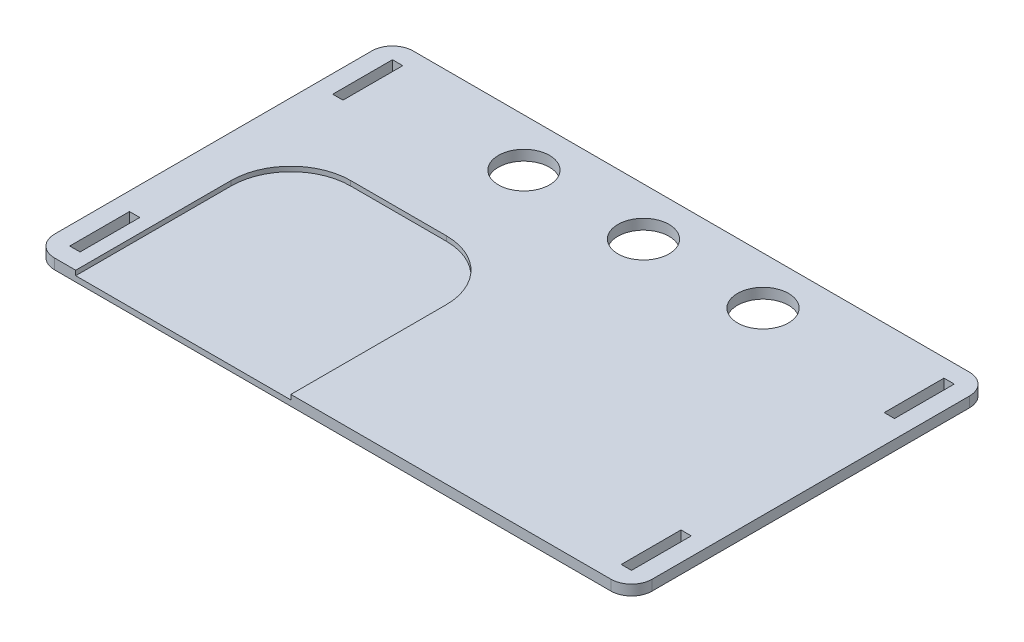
ISO-10303-21;
HEADER;
FILE_DESCRIPTION(('STEP AP214'),'2;1');
FILE_NAME('part.step','',(''),(''),'','','');
FILE_SCHEMA(('AUTOMOTIVE_DESIGN { 1 0 10303 214 1 1 1 1 }'));
ENDSEC;
DATA;
#1=APPLICATION_CONTEXT('core data for automotive mechanical design processes');
#2=APPLICATION_PROTOCOL_DEFINITION('international standard','automotive_design',2000,#1);
#3=PRODUCT_CONTEXT('',#1,'mechanical');
#4=PRODUCT('Part','Part','',(#3));
#5=PRODUCT_RELATED_PRODUCT_CATEGORY('part','',(#4));
#6=PRODUCT_DEFINITION_FORMATION('','',#4);
#7=PRODUCT_DEFINITION_CONTEXT('part definition',#1,'design');
#8=PRODUCT_DEFINITION('design','',#6,#7);
#9=PRODUCT_DEFINITION_SHAPE('','',#8);
#10=(LENGTH_UNIT() NAMED_UNIT(*) SI_UNIT(.MILLI.,.METRE.));
#11=(NAMED_UNIT(*) PLANE_ANGLE_UNIT() SI_UNIT($,.RADIAN.));
#12=(NAMED_UNIT(*) SI_UNIT($,.STERADIAN.) SOLID_ANGLE_UNIT());
#13=UNCERTAINTY_MEASURE_WITH_UNIT(LENGTH_MEASURE(1.E-05),#10,'distance_accuracy_value','');
#14=(GEOMETRIC_REPRESENTATION_CONTEXT(3) GLOBAL_UNCERTAINTY_ASSIGNED_CONTEXT((#13)) GLOBAL_UNIT_ASSIGNED_CONTEXT((#10,
#11,#12)) REPRESENTATION_CONTEXT('',''));
#15=CARTESIAN_POINT('',(0.,0.,0.));
#16=DIRECTION('',(0.,0.,1.));
#17=DIRECTION('',(1.,0.,0.));
#18=AXIS2_PLACEMENT_3D('',#15,#16,#17);
#19=CARTESIAN_POINT('',(0.,17.25,0.));
#20=DIRECTION('',(0.,-1.,0.));
#21=DIRECTION('',(0.,0.,-1.));
#22=AXIS2_PLACEMENT_3D('',#19,#20,#21);
#23=PLANE('',#22);
#24=CARTESIAN_POINT('',(-200.,17.25,-220.));
#25=DIRECTION('',(0.,-1.,0.));
#26=DIRECTION('',(0.,0.,-1.));
#27=AXIS2_PLACEMENT_3D('',#24,#25,#26);
#28=CIRCLE('',#27,42.75);
#29=CARTESIAN_POINT('',(-200.,17.25,-262.75));
#30=VERTEX_POINT('',#29);
#31=EDGE_CURVE('E844',#30,#30,#28,.T.);
#32=ORIENTED_EDGE('',*,*,#31,.T.);
#33=EDGE_LOOP('',(#32));
#34=FACE_BOUND('',#33,.T.);
#35=DIRECTION('',(0.,0.,-1.));
#36=VECTOR('',#35,1.);
#37=CARTESIAN_POINT('',(452.75,17.25,0.));
#38=LINE('',#37,#36);
#39=CARTESIAN_POINT('',(452.75,17.25,270.));
#40=VERTEX_POINT('',#39);
#41=CARTESIAN_POINT('',(452.75,17.25,170.));
#42=VERTEX_POINT('',#41);
#43=EDGE_CURVE('E48',#40,#42,#38,.T.);
#44=ORIENTED_EDGE('',*,*,#43,.T.);
#45=DIRECTION('',(1.,0.,0.));
#46=VECTOR('',#45,1.);
#47=CARTESIAN_POINT('',(-2.73533208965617E-13,17.25,169.999999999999));
#48=LINE('',#47,#46);
#49=CARTESIAN_POINT('',(470.,17.25,170.));
#50=VERTEX_POINT('',#49);
#51=EDGE_CURVE('E244',#42,#50,#48,.T.);
#52=ORIENTED_EDGE('',*,*,#51,.T.);
#53=DIRECTION('',(0.,0.,1.));
#54=VECTOR('',#53,1.);
#55=CARTESIAN_POINT('',(470.,17.25,0.));
#56=LINE('',#55,#54);
#57=CARTESIAN_POINT('',(470.,17.25,270.));
#58=VERTEX_POINT('',#57);
#59=EDGE_CURVE('E261',#50,#58,#56,.T.);
#60=ORIENTED_EDGE('',*,*,#59,.T.);
#61=DIRECTION('',(-1.,0.,0.));
#62=VECTOR('',#61,1.);
#63=CARTESIAN_POINT('',(0.,17.25,270.));
#64=LINE('',#63,#62);
#65=EDGE_CURVE('E238',#58,#40,#64,.T.);
#66=ORIENTED_EDGE('',*,*,#65,.T.);
#67=EDGE_LOOP('',(#44,#52,#60,#66));
#68=FACE_BOUND('',#67,.T.);
#69=DIRECTION('',(-1.,0.,0.));
#70=VECTOR('',#69,1.);
#71=CARTESIAN_POINT('',(0.,17.25,-270.));
#72=LINE('',#71,#70);
#73=CARTESIAN_POINT('',(470.,17.25,-270.));
#74=VERTEX_POINT('',#73);
#75=CARTESIAN_POINT('',(452.75,17.25,-270.));
#76=VERTEX_POINT('',#75);
#77=EDGE_CURVE('E284',#74,#76,#72,.T.);
#78=ORIENTED_EDGE('',*,*,#77,.F.);
#79=DIRECTION('',(0.,0.,-1.));
#80=VECTOR('',#79,1.);
#81=CARTESIAN_POINT('',(470.,17.25,0.));
#82=LINE('',#81,#80);
#83=CARTESIAN_POINT('',(470.,17.25,-170.));
#84=VERTEX_POINT('',#83);
#85=EDGE_CURVE('E245',#84,#74,#82,.T.);
#86=ORIENTED_EDGE('',*,*,#85,.F.);
#87=DIRECTION('',(1.,0.,0.));
#88=VECTOR('',#87,1.);
#89=CARTESIAN_POINT('',(-2.73533208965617E-13,17.25,-169.999999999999));
#90=LINE('',#89,#88);
#91=CARTESIAN_POINT('',(452.75,17.25,-170.));
#92=VERTEX_POINT('',#91);
#93=EDGE_CURVE('E273',#92,#84,#90,.T.);
#94=ORIENTED_EDGE('',*,*,#93,.F.);
#95=DIRECTION('',(0.,0.,1.));
#96=VECTOR('',#95,1.);
#97=CARTESIAN_POINT('',(452.75,17.25,0.));
#98=LINE('',#97,#96);
#99=EDGE_CURVE('E287',#76,#92,#98,.T.);
#100=ORIENTED_EDGE('',*,*,#99,.F.);
#101=EDGE_LOOP('',(#78,#86,#94,#100));
#102=FACE_BOUND('',#101,.T.);
#103=DIRECTION('',(1.,0.,0.));
#104=VECTOR('',#103,1.);
#105=CARTESIAN_POINT('',(-500.,17.25,300.));
#106=LINE('',#105,#104);
#107=CARTESIAN_POINT('',(-465.5,17.25,300.));
#108=VERTEX_POINT('',#107);
#109=CARTESIAN_POINT('',(-430.,17.25,300.));
#110=VERTEX_POINT('',#109);
#111=EDGE_CURVE('E399',#108,#110,#106,.T.);
#112=ORIENTED_EDGE('',*,*,#111,.T.);
#113=DIRECTION('',(0.,0.,1.));
#114=VECTOR('',#113,1.);
#115=CARTESIAN_POINT('',(-430.,17.25,0.));
#116=LINE('',#115,#114);
#117=CARTESIAN_POINT('',(-430.,17.25,40.0000000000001));
#118=VERTEX_POINT('',#117);
#119=EDGE_CURVE('E357',#118,#110,#116,.T.);
#120=ORIENTED_EDGE('',*,*,#119,.F.);
#121=CARTESIAN_POINT('',(-330.,17.25,40.0000000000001));
#122=DIRECTION('',(0.,-1.,0.));
#123=DIRECTION('',(0.,0.,-1.));
#124=AXIS2_PLACEMENT_3D('',#121,#122,#123);
#125=CIRCLE('',#124,100.);
#126=CARTESIAN_POINT('',(-330.,17.25,-59.9999999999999));
#127=VERTEX_POINT('',#126);
#128=EDGE_CURVE('E11',#118,#127,#125,.T.);
#129=ORIENTED_EDGE('',*,*,#128,.T.);
#130=DIRECTION('',(-1.,0.,0.));
#131=VECTOR('',#130,1.);
#132=CARTESIAN_POINT('',(0.,17.25,-59.9999999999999));
#133=LINE('',#132,#131);
#134=CARTESIAN_POINT('',(-170.,17.25,-59.9999999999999));
#135=VERTEX_POINT('',#134);
#136=EDGE_CURVE('E367',#135,#127,#133,.T.);
#137=ORIENTED_EDGE('',*,*,#136,.F.);
#138=CARTESIAN_POINT('',(-170.,17.25,40.0000000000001));
#139=DIRECTION('',(0.,-1.,0.));
#140=DIRECTION('',(0.,0.,-1.));
#141=AXIS2_PLACEMENT_3D('',#138,#139,#140);
#142=CIRCLE('',#141,100.);
#143=CARTESIAN_POINT('',(-70.,17.25,40.0000000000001));
#144=VERTEX_POINT('',#143);
#145=EDGE_CURVE('E41',#135,#144,#142,.T.);
#146=ORIENTED_EDGE('',*,*,#145,.T.);
#147=DIRECTION('',(0.,0.,-1.));
#148=VECTOR('',#147,1.);
#149=CARTESIAN_POINT('',(-70.,17.25,0.));
#150=LINE('',#149,#148);
#151=CARTESIAN_POINT('',(-70.,17.25,300.));
#152=VERTEX_POINT('',#151);
#153=EDGE_CURVE('E378',#152,#144,#150,.T.);
#154=ORIENTED_EDGE('',*,*,#153,.F.);
#155=CARTESIAN_POINT('',(465.5,17.25,300.));
#156=VERTEX_POINT('',#155);
#157=EDGE_CURVE('E398',#152,#156,#106,.T.);
#158=ORIENTED_EDGE('',*,*,#157,.T.);
#159=CARTESIAN_POINT('',(465.5,17.25,265.5));
#160=DIRECTION('',(0.,-1.,0.));
#161=DIRECTION('',(0.,0.,-1.));
#162=AXIS2_PLACEMENT_3D('',#159,#160,#161);
#163=CIRCLE('',#162,34.5);
#164=CARTESIAN_POINT('',(500.,17.25,265.5));
#165=VERTEX_POINT('',#164);
#166=EDGE_CURVE('E437',#156,#165,#163,.F.);
#167=ORIENTED_EDGE('',*,*,#166,.T.);
#168=DIRECTION('',(0.,0.,-1.));
#169=VECTOR('',#168,1.);
#170=CARTESIAN_POINT('',(500.,17.25,300.));
#171=LINE('',#170,#169);
#172=CARTESIAN_POINT('',(500.,17.25,-265.5));
#173=VERTEX_POINT('',#172);
#174=EDGE_CURVE('E388',#165,#173,#171,.T.);
#175=ORIENTED_EDGE('',*,*,#174,.T.);
#176=CARTESIAN_POINT('',(465.5,17.25,-265.5));
#177=DIRECTION('',(0.,-1.,0.));
#178=DIRECTION('',(0.,0.,-1.));
#179=AXIS2_PLACEMENT_3D('',#176,#177,#178);
#180=CIRCLE('',#179,34.5);
#181=CARTESIAN_POINT('',(465.5,17.25,-300.));
#182=VERTEX_POINT('',#181);
#183=EDGE_CURVE('E435',#173,#182,#180,.F.);
#184=ORIENTED_EDGE('',*,*,#183,.T.);
#185=DIRECTION('',(-1.,0.,0.));
#186=VECTOR('',#185,1.);
#187=CARTESIAN_POINT('',(-500.,17.25,-300.));
#188=LINE('',#187,#186);
#189=CARTESIAN_POINT('',(-465.5,17.25,-300.));
#190=VERTEX_POINT('',#189);
#191=EDGE_CURVE('E391',#182,#190,#188,.T.);
#192=ORIENTED_EDGE('',*,*,#191,.T.);
#193=CARTESIAN_POINT('',(-465.5,17.25,-265.5));
#194=DIRECTION('',(0.,-1.,0.));
#195=DIRECTION('',(0.,0.,-1.));
#196=AXIS2_PLACEMENT_3D('',#193,#194,#195);
#197=CIRCLE('',#196,34.5);
#198=CARTESIAN_POINT('',(-500.,17.25,-265.5));
#199=VERTEX_POINT('',#198);
#200=EDGE_CURVE('E431',#190,#199,#197,.F.);
#201=ORIENTED_EDGE('',*,*,#200,.T.);
#202=DIRECTION('',(0.,0.,1.));
#203=VECTOR('',#202,1.);
#204=CARTESIAN_POINT('',(-500.,17.25,300.));
#205=LINE('',#204,#203);
#206=CARTESIAN_POINT('',(-500.,17.25,265.5));
#207=VERTEX_POINT('',#206);
#208=EDGE_CURVE('E395',#199,#207,#205,.T.);
#209=ORIENTED_EDGE('',*,*,#208,.T.);
#210=CARTESIAN_POINT('',(-465.5,17.25,265.5));
#211=DIRECTION('',(0.,-1.,0.));
#212=DIRECTION('',(0.,0.,-1.));
#213=AXIS2_PLACEMENT_3D('',#210,#211,#212);
#214=CIRCLE('',#213,34.5);
#215=EDGE_CURVE('E433',#207,#108,#214,.F.);
#216=ORIENTED_EDGE('',*,*,#215,.T.);
#217=EDGE_LOOP('',(#112,#120,#129,#137,#146,#154,#158,#167,#175,#184,#192,#201,#209,#216));
#218=FACE_BOUND('',#217,.T.);
#219=DIRECTION('',(1.,0.,0.));
#220=VECTOR('',#219,1.);
#221=CARTESIAN_POINT('',(0.,17.25,270.));
#222=LINE('',#221,#220);
#223=CARTESIAN_POINT('',(-470.,17.25,270.));
#224=VERTEX_POINT('',#223);
#225=CARTESIAN_POINT('',(-452.75,17.25,270.));
#226=VERTEX_POINT('',#225);
#227=EDGE_CURVE('E347',#224,#226,#222,.T.);
#228=ORIENTED_EDGE('',*,*,#227,.F.);
#229=DIRECTION('',(0.,0.,1.));
#230=VECTOR('',#229,1.);
#231=CARTESIAN_POINT('',(-470.,17.25,0.));
#232=LINE('',#231,#230);
#233=CARTESIAN_POINT('',(-470.,17.25,170.));
#234=VERTEX_POINT('',#233);
#235=EDGE_CURVE('E331',#234,#224,#232,.T.);
#236=ORIENTED_EDGE('',*,*,#235,.F.);
#237=DIRECTION('',(-1.,0.,0.));
#238=VECTOR('',#237,1.);
#239=CARTESIAN_POINT('',(2.73533208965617E-13,17.25,169.999999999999));
#240=LINE('',#239,#238);
#241=CARTESIAN_POINT('',(-452.75,17.25,170.));
#242=VERTEX_POINT('',#241);
#243=EDGE_CURVE('E336',#242,#234,#240,.T.);
#244=ORIENTED_EDGE('',*,*,#243,.F.);
#245=DIRECTION('',(0.,0.,-1.));
#246=VECTOR('',#245,1.);
#247=CARTESIAN_POINT('',(-452.75,17.25,0.));
#248=LINE('',#247,#246);
#249=EDGE_CURVE('E350',#226,#242,#248,.T.);
#250=ORIENTED_EDGE('',*,*,#249,.F.);
#251=EDGE_LOOP('',(#228,#236,#244,#250));
#252=FACE_BOUND('',#251,.T.);
#253=DIRECTION('',(0.,0.,1.));
#254=VECTOR('',#253,1.);
#255=CARTESIAN_POINT('',(-452.75,17.25,0.));
#256=LINE('',#255,#254);
#257=CARTESIAN_POINT('',(-452.75,17.25,-270.));
#258=VERTEX_POINT('',#257);
#259=CARTESIAN_POINT('',(-452.75,17.25,-170.));
#260=VERTEX_POINT('',#259);
#261=EDGE_CURVE('E294',#258,#260,#256,.T.);
#262=ORIENTED_EDGE('',*,*,#261,.T.);
#263=DIRECTION('',(-1.,0.,0.));
#264=VECTOR('',#263,1.);
#265=CARTESIAN_POINT('',(2.73533208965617E-13,17.25,-169.999999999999));
#266=LINE('',#265,#264);
#267=CARTESIAN_POINT('',(-470.,17.25,-170.));
#268=VERTEX_POINT('',#267);
#269=EDGE_CURVE('E314',#260,#268,#266,.T.);
#270=ORIENTED_EDGE('',*,*,#269,.T.);
#271=DIRECTION('',(0.,0.,-1.));
#272=VECTOR('',#271,1.);
#273=CARTESIAN_POINT('',(-470.,17.25,0.));
#274=LINE('',#273,#272);
#275=CARTESIAN_POINT('',(-470.,17.25,-270.));
#276=VERTEX_POINT('',#275);
#277=EDGE_CURVE('E317',#268,#276,#274,.T.);
#278=ORIENTED_EDGE('',*,*,#277,.T.);
#279=DIRECTION('',(1.,0.,0.));
#280=VECTOR('',#279,1.);
#281=CARTESIAN_POINT('',(0.,17.25,-270.));
#282=LINE('',#281,#280);
#283=EDGE_CURVE('E304',#276,#258,#282,.T.);
#284=ORIENTED_EDGE('',*,*,#283,.T.);
#285=EDGE_LOOP('',(#262,#270,#278,#284));
#286=FACE_BOUND('',#285,.T.);
#287=CARTESIAN_POINT('',(0.,17.25,-220.));
#288=DIRECTION('',(0.,-1.,0.));
#289=DIRECTION('',(0.,0.,-1.));
#290=AXIS2_PLACEMENT_3D('',#287,#288,#289);
#291=CIRCLE('',#290,42.75);
#292=CARTESIAN_POINT('',(0.,17.25,-262.75));
#293=VERTEX_POINT('',#292);
#294=EDGE_CURVE('E850',#293,#293,#291,.T.);
#295=ORIENTED_EDGE('',*,*,#294,.T.);
#296=EDGE_LOOP('',(#295));
#297=FACE_BOUND('',#296,.T.);
#298=CARTESIAN_POINT('',(200.,17.25,-220.));
#299=DIRECTION('',(0.,-1.,0.));
#300=DIRECTION('',(0.,0.,-1.));
#301=AXIS2_PLACEMENT_3D('',#298,#299,#300);
#302=CIRCLE('',#301,42.75);
#303=CARTESIAN_POINT('',(200.,17.25,-262.75));
#304=VERTEX_POINT('',#303);
#305=EDGE_CURVE('E841',#304,#304,#302,.T.);
#306=ORIENTED_EDGE('',*,*,#305,.T.);
#307=EDGE_LOOP('',(#306));
#308=FACE_BOUND('',#307,.T.);
#309=ADVANCED_FACE('F33',(#34,#68,#102,#218,#252,#286,#297,#308),#23,.F.);
#310=CARTESIAN_POINT('',(0.,0.,0.));
#311=DIRECTION('',(0.,-1.,0.));
#312=DIRECTION('',(0.,0.,-1.));
#313=AXIS2_PLACEMENT_3D('',#310,#311,#312);
#314=PLANE('',#313);
#315=CARTESIAN_POINT('',(-200.,0.,-220.));
#316=DIRECTION('',(0.,-1.,0.));
#317=DIRECTION('',(0.,0.,-1.));
#318=AXIS2_PLACEMENT_3D('',#315,#316,#317);
#319=CIRCLE('',#318,42.75);
#320=CARTESIAN_POINT('',(-200.,0.,-262.75));
#321=VERTEX_POINT('',#320);
#322=EDGE_CURVE('E847',#321,#321,#319,.T.);
#323=ORIENTED_EDGE('',*,*,#322,.F.);
#324=EDGE_LOOP('',(#323));
#325=FACE_BOUND('',#324,.T.);
#326=DIRECTION('',(1.,0.,0.));
#327=VECTOR('',#326,1.);
#328=CARTESIAN_POINT('',(-2.73533208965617E-13,0.,169.999999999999));
#329=LINE('',#328,#327);
#330=CARTESIAN_POINT('',(452.75,0.,170.));
#331=VERTEX_POINT('',#330);
#332=CARTESIAN_POINT('',(470.,0.,170.));
#333=VERTEX_POINT('',#332);
#334=EDGE_CURVE('E237',#331,#333,#329,.T.);
#335=ORIENTED_EDGE('',*,*,#334,.F.);
#336=DIRECTION('',(0.,0.,-1.));
#337=VECTOR('',#336,1.);
#338=CARTESIAN_POINT('',(452.75,0.,0.));
#339=LINE('',#338,#337);
#340=CARTESIAN_POINT('',(452.75,0.,270.));
#341=VERTEX_POINT('',#340);
#342=EDGE_CURVE('E229',#341,#331,#339,.T.);
#343=ORIENTED_EDGE('',*,*,#342,.F.);
#344=DIRECTION('',(-1.,0.,0.));
#345=VECTOR('',#344,1.);
#346=CARTESIAN_POINT('',(0.,0.,270.));
#347=LINE('',#346,#345);
#348=CARTESIAN_POINT('',(470.,0.,270.));
#349=VERTEX_POINT('',#348);
#350=EDGE_CURVE('E253',#349,#341,#347,.T.);
#351=ORIENTED_EDGE('',*,*,#350,.F.);
#352=DIRECTION('',(0.,0.,1.));
#353=VECTOR('',#352,1.);
#354=CARTESIAN_POINT('',(470.,0.,0.));
#355=LINE('',#354,#353);
#356=EDGE_CURVE('E251',#333,#349,#355,.T.);
#357=ORIENTED_EDGE('',*,*,#356,.F.);
#358=EDGE_LOOP('',(#335,#343,#351,#357));
#359=FACE_BOUND('',#358,.T.);
#360=DIRECTION('',(0.,0.,-1.));
#361=VECTOR('',#360,1.);
#362=CARTESIAN_POINT('',(470.,0.,0.));
#363=LINE('',#362,#361);
#364=CARTESIAN_POINT('',(470.,0.,-170.));
#365=VERTEX_POINT('',#364);
#366=CARTESIAN_POINT('',(470.,0.,-270.));
#367=VERTEX_POINT('',#366);
#368=EDGE_CURVE('E269',#365,#367,#363,.T.);
#369=ORIENTED_EDGE('',*,*,#368,.T.);
#370=DIRECTION('',(-1.,0.,0.));
#371=VECTOR('',#370,1.);
#372=CARTESIAN_POINT('',(0.,0.,-270.));
#373=LINE('',#372,#371);
#374=CARTESIAN_POINT('',(452.75,0.,-270.));
#375=VERTEX_POINT('',#374);
#376=EDGE_CURVE('E272',#367,#375,#373,.T.);
#377=ORIENTED_EDGE('',*,*,#376,.T.);
#378=DIRECTION('',(0.,0.,1.));
#379=VECTOR('',#378,1.);
#380=CARTESIAN_POINT('',(452.75,0.,0.));
#381=LINE('',#380,#379);
#382=CARTESIAN_POINT('',(452.75,0.,-170.));
#383=VERTEX_POINT('',#382);
#384=EDGE_CURVE('E276',#375,#383,#381,.T.);
#385=ORIENTED_EDGE('',*,*,#384,.T.);
#386=DIRECTION('',(1.,0.,0.));
#387=VECTOR('',#386,1.);
#388=CARTESIAN_POINT('',(-2.73533208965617E-13,0.,-169.999999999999));
#389=LINE('',#388,#387);
#390=EDGE_CURVE('E279',#383,#365,#389,.T.);
#391=ORIENTED_EDGE('',*,*,#390,.T.);
#392=EDGE_LOOP('',(#369,#377,#385,#391));
#393=FACE_BOUND('',#392,.T.);
#394=DIRECTION('',(0.,0.,-1.));
#395=VECTOR('',#394,1.);
#396=CARTESIAN_POINT('',(500.,0.,300.));
#397=LINE('',#396,#395);
#398=CARTESIAN_POINT('',(500.,0.,265.5));
#399=VERTEX_POINT('',#398);
#400=CARTESIAN_POINT('',(500.,0.,-265.5));
#401=VERTEX_POINT('',#400);
#402=EDGE_CURVE('E385',#399,#401,#397,.T.);
#403=ORIENTED_EDGE('',*,*,#402,.F.);
#404=CARTESIAN_POINT('',(465.5,0.,265.5));
#405=DIRECTION('',(0.,-1.,0.));
#406=DIRECTION('',(0.,0.,-1.));
#407=AXIS2_PLACEMENT_3D('',#404,#405,#406);
#408=CIRCLE('',#407,34.5);
#409=CARTESIAN_POINT('',(465.5,0.,300.));
#410=VERTEX_POINT('',#409);
#411=EDGE_CURVE('E423',#399,#410,#408,.T.);
#412=ORIENTED_EDGE('',*,*,#411,.T.);
#413=DIRECTION('',(1.,0.,0.));
#414=VECTOR('',#413,1.);
#415=CARTESIAN_POINT('',(-500.,0.,300.));
#416=LINE('',#415,#414);
#417=CARTESIAN_POINT('',(-465.5,0.,300.));
#418=VERTEX_POINT('',#417);
#419=EDGE_CURVE('E392',#418,#410,#416,.T.);
#420=ORIENTED_EDGE('',*,*,#419,.F.);
#421=CARTESIAN_POINT('',(-465.5,0.,265.5));
#422=DIRECTION('',(0.,-1.,0.));
#423=DIRECTION('',(0.,0.,-1.));
#424=AXIS2_PLACEMENT_3D('',#421,#422,#423);
#425=CIRCLE('',#424,34.5);
#426=CARTESIAN_POINT('',(-500.,0.,265.5));
#427=VERTEX_POINT('',#426);
#428=EDGE_CURVE('E419',#418,#427,#425,.T.);
#429=ORIENTED_EDGE('',*,*,#428,.T.);
#430=DIRECTION('',(0.,0.,1.));
#431=VECTOR('',#430,1.);
#432=CARTESIAN_POINT('',(-500.,0.,300.));
#433=LINE('',#432,#431);
#434=CARTESIAN_POINT('',(-500.,0.,-265.5));
#435=VERTEX_POINT('',#434);
#436=EDGE_CURVE('E408',#435,#427,#433,.T.);
#437=ORIENTED_EDGE('',*,*,#436,.F.);
#438=CARTESIAN_POINT('',(-465.5,0.,-265.5));
#439=DIRECTION('',(0.,-1.,0.));
#440=DIRECTION('',(0.,0.,-1.));
#441=AXIS2_PLACEMENT_3D('',#438,#439,#440);
#442=CIRCLE('',#441,34.5);
#443=CARTESIAN_POINT('',(-465.5,0.,-300.));
#444=VERTEX_POINT('',#443);
#445=EDGE_CURVE('E417',#435,#444,#442,.T.);
#446=ORIENTED_EDGE('',*,*,#445,.T.);
#447=DIRECTION('',(-1.,0.,0.));
#448=VECTOR('',#447,1.);
#449=CARTESIAN_POINT('',(-500.,0.,-300.));
#450=LINE('',#449,#448);
#451=CARTESIAN_POINT('',(465.5,0.,-300.));
#452=VERTEX_POINT('',#451);
#453=EDGE_CURVE('E405',#452,#444,#450,.T.);
#454=ORIENTED_EDGE('',*,*,#453,.F.);
#455=CARTESIAN_POINT('',(465.5,0.,-265.5));
#456=DIRECTION('',(0.,-1.,0.));
#457=DIRECTION('',(0.,0.,-1.));
#458=AXIS2_PLACEMENT_3D('',#455,#456,#457);
#459=CIRCLE('',#458,34.5);
#460=EDGE_CURVE('E421',#452,#401,#459,.T.);
#461=ORIENTED_EDGE('',*,*,#460,.T.);
#462=EDGE_LOOP('',(#403,#412,#420,#429,#437,#446,#454,#461));
#463=FACE_BOUND('',#462,.T.);
#464=DIRECTION('',(0.,0.,1.));
#465=VECTOR('',#464,1.);
#466=CARTESIAN_POINT('',(-470.,0.,0.));
#467=LINE('',#466,#465);
#468=CARTESIAN_POINT('',(-470.,0.,170.));
#469=VERTEX_POINT('',#468);
#470=CARTESIAN_POINT('',(-470.,0.,270.));
#471=VERTEX_POINT('',#470);
#472=EDGE_CURVE('E332',#469,#471,#467,.T.);
#473=ORIENTED_EDGE('',*,*,#472,.T.);
#474=DIRECTION('',(1.,0.,0.));
#475=VECTOR('',#474,1.);
#476=CARTESIAN_POINT('',(0.,0.,270.));
#477=LINE('',#476,#475);
#478=CARTESIAN_POINT('',(-452.75,0.,270.));
#479=VERTEX_POINT('',#478);
#480=EDGE_CURVE('E335',#471,#479,#477,.T.);
#481=ORIENTED_EDGE('',*,*,#480,.T.);
#482=DIRECTION('',(0.,0.,-1.));
#483=VECTOR('',#482,1.);
#484=CARTESIAN_POINT('',(-452.75,0.,0.));
#485=LINE('',#484,#483);
#486=CARTESIAN_POINT('',(-452.75,0.,170.));
#487=VERTEX_POINT('',#486);
#488=EDGE_CURVE('E339',#479,#487,#485,.T.);
#489=ORIENTED_EDGE('',*,*,#488,.T.);
#490=DIRECTION('',(-1.,0.,0.));
#491=VECTOR('',#490,1.);
#492=CARTESIAN_POINT('',(2.73533208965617E-13,0.,169.999999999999));
#493=LINE('',#492,#491);
#494=EDGE_CURVE('E342',#487,#469,#493,.T.);
#495=ORIENTED_EDGE('',*,*,#494,.T.);
#496=EDGE_LOOP('',(#473,#481,#489,#495));
#497=FACE_BOUND('',#496,.T.);
#498=DIRECTION('',(-1.,0.,0.));
#499=VECTOR('',#498,1.);
#500=CARTESIAN_POINT('',(2.73533208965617E-13,0.,-169.999999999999));
#501=LINE('',#500,#499);
#502=CARTESIAN_POINT('',(-452.75,0.,-170.));
#503=VERTEX_POINT('',#502);
#504=CARTESIAN_POINT('',(-470.,0.,-170.));
#505=VERTEX_POINT('',#504);
#506=EDGE_CURVE('E303',#503,#505,#501,.T.);
#507=ORIENTED_EDGE('',*,*,#506,.F.);
#508=DIRECTION('',(0.,0.,1.));
#509=VECTOR('',#508,1.);
#510=CARTESIAN_POINT('',(-452.75,0.,0.));
#511=LINE('',#510,#509);
#512=CARTESIAN_POINT('',(-452.75,0.,-270.));
#513=VERTEX_POINT('',#512);
#514=EDGE_CURVE('E301',#513,#503,#511,.T.);
#515=ORIENTED_EDGE('',*,*,#514,.F.);
#516=DIRECTION('',(1.,0.,0.));
#517=VECTOR('',#516,1.);
#518=CARTESIAN_POINT('',(0.,0.,-270.));
#519=LINE('',#518,#517);
#520=CARTESIAN_POINT('',(-470.,0.,-270.));
#521=VERTEX_POINT('',#520);
#522=EDGE_CURVE('E309',#521,#513,#519,.T.);
#523=ORIENTED_EDGE('',*,*,#522,.F.);
#524=DIRECTION('',(0.,0.,-1.));
#525=VECTOR('',#524,1.);
#526=CARTESIAN_POINT('',(-470.,0.,0.));
#527=LINE('',#526,#525);
#528=EDGE_CURVE('E306',#505,#521,#527,.T.);
#529=ORIENTED_EDGE('',*,*,#528,.F.);
#530=EDGE_LOOP('',(#507,#515,#523,#529));
#531=FACE_BOUND('',#530,.T.);
#532=CARTESIAN_POINT('',(0.,0.,-220.));
#533=DIRECTION('',(0.,-1.,0.));
#534=DIRECTION('',(0.,0.,-1.));
#535=AXIS2_PLACEMENT_3D('',#532,#533,#534);
#536=CIRCLE('',#535,42.75);
#537=CARTESIAN_POINT('',(0.,0.,-262.75));
#538=VERTEX_POINT('',#537);
#539=EDGE_CURVE('E259',#538,#538,#536,.T.);
#540=ORIENTED_EDGE('',*,*,#539,.F.);
#541=EDGE_LOOP('',(#540));
#542=FACE_BOUND('',#541,.T.);
#543=CARTESIAN_POINT('',(200.,0.,-220.));
#544=DIRECTION('',(0.,-1.,0.));
#545=DIRECTION('',(0.,0.,-1.));
#546=AXIS2_PLACEMENT_3D('',#543,#544,#545);
#547=CIRCLE('',#546,42.75);
#548=CARTESIAN_POINT('',(200.,0.,-262.75));
#549=VERTEX_POINT('',#548);
#550=EDGE_CURVE('E838',#549,#549,#547,.T.);
#551=ORIENTED_EDGE('',*,*,#550,.F.);
#552=EDGE_LOOP('',(#551));
#553=FACE_BOUND('',#552,.T.);
#554=ADVANCED_FACE('F249',(#325,#359,#393,#463,#497,#531,#542,#553),#314,.T.);
#555=CARTESIAN_POINT('',(500.,17.25,300.));
#556=DIRECTION('',(-1.,0.,0.));
#557=DIRECTION('',(0.,0.,1.));
#558=AXIS2_PLACEMENT_3D('',#555,#556,#557);
#559=PLANE('',#558);
#560=ORIENTED_EDGE('',*,*,#174,.F.);
#561=DIRECTION('',(0.,-1.,0.));
#562=VECTOR('',#561,1.);
#563=CARTESIAN_POINT('',(500.,17.25,265.5));
#564=LINE('',#563,#562);
#565=EDGE_CURVE('E414',#165,#399,#564,.T.);
#566=ORIENTED_EDGE('',*,*,#565,.T.);
#567=ORIENTED_EDGE('',*,*,#402,.T.);
#568=DIRECTION('',(0.,-1.,0.));
#569=VECTOR('',#568,1.);
#570=CARTESIAN_POINT('',(500.,17.25,-265.5));
#571=LINE('',#570,#569);
#572=EDGE_CURVE('E402',#401,#173,#571,.F.);
#573=ORIENTED_EDGE('',*,*,#572,.T.);
#574=EDGE_LOOP('',(#560,#566,#567,#573));
#575=FACE_BOUND('',#574,.T.);
#576=ADVANCED_FACE('F500',(#575),#559,.F.);
#577=CARTESIAN_POINT('',(-500.,17.25,-300.));
#578=DIRECTION('',(0.,0.,1.));
#579=DIRECTION('',(1.,0.,0.));
#580=AXIS2_PLACEMENT_3D('',#577,#578,#579);
#581=PLANE('',#580);
#582=ORIENTED_EDGE('',*,*,#191,.F.);
#583=DIRECTION('',(0.,-1.,0.));
#584=VECTOR('',#583,1.);
#585=CARTESIAN_POINT('',(465.5,17.25,-300.));
#586=LINE('',#585,#584);
#587=EDGE_CURVE('E441',#182,#452,#586,.T.);
#588=ORIENTED_EDGE('',*,*,#587,.T.);
#589=ORIENTED_EDGE('',*,*,#453,.T.);
#590=DIRECTION('',(0.,-1.,0.));
#591=VECTOR('',#590,1.);
#592=CARTESIAN_POINT('',(-465.5,17.25,-300.));
#593=LINE('',#592,#591);
#594=EDGE_CURVE('E439',#444,#190,#593,.F.);
#595=ORIENTED_EDGE('',*,*,#594,.T.);
#596=EDGE_LOOP('',(#582,#588,#589,#595));
#597=FACE_BOUND('',#596,.T.);
#598=ADVANCED_FACE('F524',(#597),#581,.F.);
#599=CARTESIAN_POINT('',(-500.,17.25,300.));
#600=DIRECTION('',(1.,0.,0.));
#601=DIRECTION('',(0.,0.,-1.));
#602=AXIS2_PLACEMENT_3D('',#599,#600,#601);
#603=PLANE('',#602);
#604=ORIENTED_EDGE('',*,*,#436,.T.);
#605=DIRECTION('',(0.,-1.,0.));
#606=VECTOR('',#605,1.);
#607=CARTESIAN_POINT('',(-500.,17.25,265.5));
#608=LINE('',#607,#606);
#609=EDGE_CURVE('E447',#427,#207,#608,.F.);
#610=ORIENTED_EDGE('',*,*,#609,.T.);
#611=ORIENTED_EDGE('',*,*,#208,.F.);
#612=DIRECTION('',(0.,-1.,0.));
#613=VECTOR('',#612,1.);
#614=CARTESIAN_POINT('',(-500.,17.25,-265.5));
#615=LINE('',#614,#613);
#616=EDGE_CURVE('E444',#199,#435,#615,.T.);
#617=ORIENTED_EDGE('',*,*,#616,.T.);
#618=EDGE_LOOP('',(#604,#610,#611,#617));
#619=FACE_BOUND('',#618,.T.);
#620=ADVANCED_FACE('F514',(#619),#603,.F.);
#621=CARTESIAN_POINT('',(-500.,17.25,300.));
#622=DIRECTION('',(0.,0.,-1.));
#623=DIRECTION('',(-1.,0.,0.));
#624=AXIS2_PLACEMENT_3D('',#621,#622,#623);
#625=PLANE('',#624);
#626=DIRECTION('',(1.,0.,0.));
#627=VECTOR('',#626,1.);
#628=CARTESIAN_POINT('',(0.,9.25,300.));
#629=LINE('',#628,#627);
#630=CARTESIAN_POINT('',(-430.,9.25,300.));
#631=VERTEX_POINT('',#630);
#632=CARTESIAN_POINT('',(-70.,9.25,300.));
#633=VERTEX_POINT('',#632);
#634=EDGE_CURVE('E366',#631,#633,#629,.T.);
#635=ORIENTED_EDGE('',*,*,#634,.F.);
#636=DIRECTION('',(0.,1.,0.));
#637=VECTOR('',#636,1.);
#638=CARTESIAN_POINT('',(-430.,9.25,300.));
#639=LINE('',#638,#637);
#640=EDGE_CURVE('E376',#631,#110,#639,.T.);
#641=ORIENTED_EDGE('',*,*,#640,.T.);
#642=ORIENTED_EDGE('',*,*,#111,.F.);
#643=DIRECTION('',(0.,-1.,0.));
#644=VECTOR('',#643,1.);
#645=CARTESIAN_POINT('',(-465.5,17.25,300.));
#646=LINE('',#645,#644);
#647=EDGE_CURVE('E425',#108,#418,#646,.T.);
#648=ORIENTED_EDGE('',*,*,#647,.T.);
#649=ORIENTED_EDGE('',*,*,#419,.T.);
#650=DIRECTION('',(0.,-1.,0.));
#651=VECTOR('',#650,1.);
#652=CARTESIAN_POINT('',(465.5,17.25,300.));
#653=LINE('',#652,#651);
#654=EDGE_CURVE('E428',#410,#156,#653,.F.);
#655=ORIENTED_EDGE('',*,*,#654,.T.);
#656=ORIENTED_EDGE('',*,*,#157,.F.);
#657=DIRECTION('',(0.,1.,0.));
#658=VECTOR('',#657,1.);
#659=CARTESIAN_POINT('',(-70.,9.25,300.));
#660=LINE('',#659,#658);
#661=EDGE_CURVE('E383',#633,#152,#660,.T.);
#662=ORIENTED_EDGE('',*,*,#661,.F.);
#663=EDGE_LOOP('',(#635,#641,#642,#648,#649,#655,#656,#662));
#664=FACE_BOUND('',#663,.T.);
#665=ADVANCED_FACE('F492',(#664),#625,.F.);
#666=CARTESIAN_POINT('',(465.5,17.25,265.5));
#667=DIRECTION('',(0.,-1.,0.));
#668=DIRECTION('',(0.,0.,-1.));
#669=AXIS2_PLACEMENT_3D('',#666,#667,#668);
#670=CYLINDRICAL_SURFACE('',#669,34.5);
#671=ORIENTED_EDGE('',*,*,#166,.F.);
#672=ORIENTED_EDGE('',*,*,#654,.F.);
#673=ORIENTED_EDGE('',*,*,#411,.F.);
#674=ORIENTED_EDGE('',*,*,#565,.F.);
#675=EDGE_LOOP('',(#671,#672,#673,#674));
#676=FACE_BOUND('',#675,.T.);
#677=ADVANCED_FACE('F503',(#676),#670,.T.);
#678=CARTESIAN_POINT('',(465.5,17.25,-265.5));
#679=DIRECTION('',(0.,-1.,0.));
#680=DIRECTION('',(0.,0.,-1.));
#681=AXIS2_PLACEMENT_3D('',#678,#679,#680);
#682=CYLINDRICAL_SURFACE('',#681,34.5);
#683=ORIENTED_EDGE('',*,*,#183,.F.);
#684=ORIENTED_EDGE('',*,*,#572,.F.);
#685=ORIENTED_EDGE('',*,*,#460,.F.);
#686=ORIENTED_EDGE('',*,*,#587,.F.);
#687=EDGE_LOOP('',(#683,#684,#685,#686));
#688=FACE_BOUND('',#687,.T.);
#689=ADVANCED_FACE('F527',(#688),#682,.T.);
#690=CARTESIAN_POINT('',(-465.5,17.25,265.5));
#691=DIRECTION('',(0.,-1.,0.));
#692=DIRECTION('',(0.,0.,-1.));
#693=AXIS2_PLACEMENT_3D('',#690,#691,#692);
#694=CYLINDRICAL_SURFACE('',#693,34.5);
#695=ORIENTED_EDGE('',*,*,#215,.F.);
#696=ORIENTED_EDGE('',*,*,#609,.F.);
#697=ORIENTED_EDGE('',*,*,#428,.F.);
#698=ORIENTED_EDGE('',*,*,#647,.F.);
#699=EDGE_LOOP('',(#695,#696,#697,#698));
#700=FACE_BOUND('',#699,.T.);
#701=ADVANCED_FACE('F510',(#700),#694,.T.);
#702=CARTESIAN_POINT('',(-465.5,17.25,-265.5));
#703=DIRECTION('',(0.,-1.,0.));
#704=DIRECTION('',(0.,0.,-1.));
#705=AXIS2_PLACEMENT_3D('',#702,#703,#704);
#706=CYLINDRICAL_SURFACE('',#705,34.5);
#707=ORIENTED_EDGE('',*,*,#200,.F.);
#708=ORIENTED_EDGE('',*,*,#594,.F.);
#709=ORIENTED_EDGE('',*,*,#445,.F.);
#710=ORIENTED_EDGE('',*,*,#616,.F.);
#711=EDGE_LOOP('',(#707,#708,#709,#710));
#712=FACE_BOUND('',#711,.T.);
#713=ADVANCED_FACE('F519',(#712),#706,.T.);
#714=CARTESIAN_POINT('',(-430.,9.25,0.));
#715=DIRECTION('',(-1.,0.,0.));
#716=DIRECTION('',(0.,0.,1.));
#717=AXIS2_PLACEMENT_3D('',#714,#715,#716);
#718=PLANE('',#717);
#719=DIRECTION('',(0.,0.,1.));
#720=VECTOR('',#719,1.);
#721=CARTESIAN_POINT('',(-430.,9.25,0.));
#722=LINE('',#721,#720);
#723=CARTESIAN_POINT('',(-430.,9.25,40.0000000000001));
#724=VERTEX_POINT('',#723);
#725=EDGE_CURVE('E364',#724,#631,#722,.T.);
#726=ORIENTED_EDGE('',*,*,#725,.F.);
#727=DIRECTION('',(0.,1.,0.));
#728=VECTOR('',#727,1.);
#729=CARTESIAN_POINT('',(-430.,17.25,40.0000000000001));
#730=LINE('',#729,#728);
#731=EDGE_CURVE('E460',#724,#118,#730,.T.);
#732=ORIENTED_EDGE('',*,*,#731,.T.);
#733=ORIENTED_EDGE('',*,*,#119,.T.);
#734=ORIENTED_EDGE('',*,*,#640,.F.);
#735=EDGE_LOOP('',(#726,#732,#733,#734));
#736=FACE_BOUND('',#735,.T.);
#737=ADVANCED_FACE('F487',(#736),#718,.F.);
#738=CARTESIAN_POINT('',(0.,9.25,-59.9999999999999));
#739=DIRECTION('',(0.,0.,-1.));
#740=DIRECTION('',(-1.,0.,0.));
#741=AXIS2_PLACEMENT_3D('',#738,#739,#740);
#742=PLANE('',#741);
#743=DIRECTION('',(-1.,0.,0.));
#744=VECTOR('',#743,1.);
#745=CARTESIAN_POINT('',(0.,9.25,-59.9999999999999));
#746=LINE('',#745,#744);
#747=CARTESIAN_POINT('',(-170.,9.25,-59.9999999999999));
#748=VERTEX_POINT('',#747);
#749=CARTESIAN_POINT('',(-330.,9.25,-59.9999999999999));
#750=VERTEX_POINT('',#749);
#751=EDGE_CURVE('E373',#748,#750,#746,.T.);
#752=ORIENTED_EDGE('',*,*,#751,.F.);
#753=DIRECTION('',(0.,1.,0.));
#754=VECTOR('',#753,1.);
#755=CARTESIAN_POINT('',(-170.,17.25,-59.9999999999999));
#756=LINE('',#755,#754);
#757=EDGE_CURVE('E451',#748,#135,#756,.T.);
#758=ORIENTED_EDGE('',*,*,#757,.T.);
#759=ORIENTED_EDGE('',*,*,#136,.T.);
#760=DIRECTION('',(0.,1.,0.));
#761=VECTOR('',#760,1.);
#762=CARTESIAN_POINT('',(-330.,9.25,-59.9999999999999));
#763=LINE('',#762,#761);
#764=EDGE_CURVE('E449',#127,#750,#763,.F.);
#765=ORIENTED_EDGE('',*,*,#764,.T.);
#766=EDGE_LOOP('',(#752,#758,#759,#765));
#767=FACE_BOUND('',#766,.T.);
#768=ADVANCED_FACE('F480',(#767),#742,.F.);
#769=CARTESIAN_POINT('',(-70.,9.25,0.));
#770=DIRECTION('',(1.,0.,0.));
#771=DIRECTION('',(0.,0.,-1.));
#772=AXIS2_PLACEMENT_3D('',#769,#770,#771);
#773=PLANE('',#772);
#774=ORIENTED_EDGE('',*,*,#153,.T.);
#775=DIRECTION('',(0.,1.,0.));
#776=VECTOR('',#775,1.);
#777=CARTESIAN_POINT('',(-70.,9.25,40.0000000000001));
#778=LINE('',#777,#776);
#779=CARTESIAN_POINT('',(-70.,9.25,40.0000000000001));
#780=VERTEX_POINT('',#779);
#781=EDGE_CURVE('E454',#144,#780,#778,.F.);
#782=ORIENTED_EDGE('',*,*,#781,.T.);
#783=DIRECTION('',(0.,0.,-1.));
#784=VECTOR('',#783,1.);
#785=CARTESIAN_POINT('',(-70.,9.25,0.));
#786=LINE('',#785,#784);
#787=EDGE_CURVE('E370',#633,#780,#786,.T.);
#788=ORIENTED_EDGE('',*,*,#787,.F.);
#789=ORIENTED_EDGE('',*,*,#661,.T.);
#790=EDGE_LOOP('',(#774,#782,#788,#789));
#791=FACE_BOUND('',#790,.T.);
#792=ADVANCED_FACE('F471',(#791),#773,.F.);
#793=CARTESIAN_POINT('',(0.,9.25,0.));
#794=DIRECTION('',(0.,1.,0.));
#795=DIRECTION('',(0.,0.,1.));
#796=AXIS2_PLACEMENT_3D('',#793,#794,#795);
#797=PLANE('',#796);
#798=ORIENTED_EDGE('',*,*,#787,.T.);
#799=CARTESIAN_POINT('',(-170.,9.25,40.0000000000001));
#800=DIRECTION('',(0.,1.,0.));
#801=DIRECTION('',(0.,0.,1.));
#802=AXIS2_PLACEMENT_3D('',#799,#800,#801);
#803=CIRCLE('',#802,100.);
#804=EDGE_CURVE('E458',#780,#748,#803,.T.);
#805=ORIENTED_EDGE('',*,*,#804,.T.);
#806=ORIENTED_EDGE('',*,*,#751,.T.);
#807=CARTESIAN_POINT('',(-330.,9.25,40.0000000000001));
#808=DIRECTION('',(0.,1.,0.));
#809=DIRECTION('',(0.,0.,1.));
#810=AXIS2_PLACEMENT_3D('',#807,#808,#809);
#811=CIRCLE('',#810,100.);
#812=EDGE_CURVE('E456',#750,#724,#811,.T.);
#813=ORIENTED_EDGE('',*,*,#812,.T.);
#814=ORIENTED_EDGE('',*,*,#725,.T.);
#815=ORIENTED_EDGE('',*,*,#634,.T.);
#816=EDGE_LOOP('',(#798,#805,#806,#813,#814,#815));
#817=FACE_BOUND('',#816,.T.);
#818=ADVANCED_FACE('F477',(#817),#797,.T.);
#819=CARTESIAN_POINT('',(-170.,9.25,40.0000000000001));
#820=DIRECTION('',(0.,-1.,0.));
#821=DIRECTION('',(0.,0.,-1.));
#822=AXIS2_PLACEMENT_3D('',#819,#820,#821);
#823=CYLINDRICAL_SURFACE('',#822,100.);
#824=ORIENTED_EDGE('',*,*,#804,.F.);
#825=ORIENTED_EDGE('',*,*,#781,.F.);
#826=ORIENTED_EDGE('',*,*,#145,.F.);
#827=ORIENTED_EDGE('',*,*,#757,.F.);
#828=EDGE_LOOP('',(#824,#825,#826,#827));
#829=FACE_BOUND('',#828,.T.);
#830=ADVANCED_FACE('F474',(#829),#823,.F.);
#831=CARTESIAN_POINT('',(-330.,9.25,40.0000000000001));
#832=DIRECTION('',(0.,-1.,0.));
#833=DIRECTION('',(0.,0.,-1.));
#834=AXIS2_PLACEMENT_3D('',#831,#832,#833);
#835=CYLINDRICAL_SURFACE('',#834,100.);
#836=ORIENTED_EDGE('',*,*,#812,.F.);
#837=ORIENTED_EDGE('',*,*,#764,.F.);
#838=ORIENTED_EDGE('',*,*,#128,.F.);
#839=ORIENTED_EDGE('',*,*,#731,.F.);
#840=EDGE_LOOP('',(#836,#837,#838,#839));
#841=FACE_BOUND('',#840,.T.);
#842=ADVANCED_FACE('F35',(#841),#835,.F.);
#843=CARTESIAN_POINT('',(-470.,0.,0.));
#844=DIRECTION('',(-1.,0.,0.));
#845=DIRECTION('',(0.,0.,1.));
#846=AXIS2_PLACEMENT_3D('',#843,#844,#845);
#847=PLANE('',#846);
#848=ORIENTED_EDGE('',*,*,#235,.T.);
#849=DIRECTION('',(0.,1.,0.));
#850=VECTOR('',#849,1.);
#851=CARTESIAN_POINT('',(-470.,0.,270.));
#852=LINE('',#851,#850);
#853=EDGE_CURVE('E345',#471,#224,#852,.T.);
#854=ORIENTED_EDGE('',*,*,#853,.F.);
#855=ORIENTED_EDGE('',*,*,#472,.F.);
#856=DIRECTION('',(0.,1.,0.));
#857=VECTOR('',#856,1.);
#858=CARTESIAN_POINT('',(-470.,0.,170.));
#859=LINE('',#858,#857);
#860=EDGE_CURVE('E355',#469,#234,#859,.T.);
#861=ORIENTED_EDGE('',*,*,#860,.T.);
#862=EDGE_LOOP('',(#848,#854,#855,#861));
#863=FACE_BOUND('',#862,.T.);
#864=ADVANCED_FACE('F629',(#863),#847,.F.);
#865=CARTESIAN_POINT('',(2.73533208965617E-13,0.,169.999999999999));
#866=DIRECTION('',(0.,0.,-1.));
#867=DIRECTION('',(-1.,0.,0.));
#868=AXIS2_PLACEMENT_3D('',#865,#866,#867);
#869=PLANE('',#868);
#870=ORIENTED_EDGE('',*,*,#243,.T.);
#871=ORIENTED_EDGE('',*,*,#860,.F.);
#872=ORIENTED_EDGE('',*,*,#494,.F.);
#873=DIRECTION('',(0.,1.,0.));
#874=VECTOR('',#873,1.);
#875=CARTESIAN_POINT('',(-452.75,0.,170.));
#876=LINE('',#875,#874);
#877=EDGE_CURVE('E358',#487,#242,#876,.T.);
#878=ORIENTED_EDGE('',*,*,#877,.T.);
#879=EDGE_LOOP('',(#870,#871,#872,#878));
#880=FACE_BOUND('',#879,.T.);
#881=ADVANCED_FACE('F635',(#880),#869,.F.);
#882=CARTESIAN_POINT('',(-452.75,0.,0.));
#883=DIRECTION('',(1.,0.,0.));
#884=DIRECTION('',(0.,0.,-1.));
#885=AXIS2_PLACEMENT_3D('',#882,#883,#884);
#886=PLANE('',#885);
#887=ORIENTED_EDGE('',*,*,#249,.T.);
#888=ORIENTED_EDGE('',*,*,#877,.F.);
#889=ORIENTED_EDGE('',*,*,#488,.F.);
#890=DIRECTION('',(0.,1.,0.));
#891=VECTOR('',#890,1.);
#892=CARTESIAN_POINT('',(-452.75,0.,270.));
#893=LINE('',#892,#891);
#894=EDGE_CURVE('E360',#479,#226,#893,.T.);
#895=ORIENTED_EDGE('',*,*,#894,.T.);
#896=EDGE_LOOP('',(#887,#888,#889,#895));
#897=FACE_BOUND('',#896,.T.);
#898=ADVANCED_FACE('F643',(#897),#886,.F.);
#899=CARTESIAN_POINT('',(0.,0.,270.));
#900=DIRECTION('',(0.,0.,1.));
#901=DIRECTION('',(1.,0.,0.));
#902=AXIS2_PLACEMENT_3D('',#899,#900,#901);
#903=PLANE('',#902);
#904=ORIENTED_EDGE('',*,*,#227,.T.);
#905=ORIENTED_EDGE('',*,*,#894,.F.);
#906=ORIENTED_EDGE('',*,*,#480,.F.);
#907=ORIENTED_EDGE('',*,*,#853,.T.);
#908=EDGE_LOOP('',(#904,#905,#906,#907));
#909=FACE_BOUND('',#908,.T.);
#910=ADVANCED_FACE('F651',(#909),#903,.F.);
#911=CARTESIAN_POINT('',(-452.75,0.,0.));
#912=DIRECTION('',(-1.,0.,0.));
#913=DIRECTION('',(0.,0.,1.));
#914=AXIS2_PLACEMENT_3D('',#911,#912,#913);
#915=PLANE('',#914);
#916=ORIENTED_EDGE('',*,*,#261,.F.);
#917=DIRECTION('',(0.,1.,0.));
#918=VECTOR('',#917,1.);
#919=CARTESIAN_POINT('',(-452.75,0.,-270.));
#920=LINE('',#919,#918);
#921=EDGE_CURVE('E311',#513,#258,#920,.T.);
#922=ORIENTED_EDGE('',*,*,#921,.F.);
#923=ORIENTED_EDGE('',*,*,#514,.T.);
#924=DIRECTION('',(0.,1.,0.));
#925=VECTOR('',#924,1.);
#926=CARTESIAN_POINT('',(-452.75,0.,-170.));
#927=LINE('',#926,#925);
#928=EDGE_CURVE('E328',#503,#260,#927,.T.);
#929=ORIENTED_EDGE('',*,*,#928,.T.);
#930=EDGE_LOOP('',(#916,#922,#923,#929));
#931=FACE_BOUND('',#930,.T.);
#932=ADVANCED_FACE('F659',(#931),#915,.T.);
#933=CARTESIAN_POINT('',(2.73533208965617E-13,0.,-169.999999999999));
#934=DIRECTION('',(0.,0.,-1.));
#935=DIRECTION('',(-1.,0.,0.));
#936=AXIS2_PLACEMENT_3D('',#933,#934,#935);
#937=PLANE('',#936);
#938=ORIENTED_EDGE('',*,*,#269,.F.);
#939=ORIENTED_EDGE('',*,*,#928,.F.);
#940=ORIENTED_EDGE('',*,*,#506,.T.);
#941=DIRECTION('',(0.,1.,0.));
#942=VECTOR('',#941,1.);
#943=CARTESIAN_POINT('',(-470.,0.,-170.));
#944=LINE('',#943,#942);
#945=EDGE_CURVE('E326',#505,#268,#944,.T.);
#946=ORIENTED_EDGE('',*,*,#945,.T.);
#947=EDGE_LOOP('',(#938,#939,#940,#946));
#948=FACE_BOUND('',#947,.T.);
#949=ADVANCED_FACE('F667',(#948),#937,.T.);
#950=CARTESIAN_POINT('',(-470.,0.,0.));
#951=DIRECTION('',(1.,0.,0.));
#952=DIRECTION('',(0.,0.,-1.));
#953=AXIS2_PLACEMENT_3D('',#950,#951,#952);
#954=PLANE('',#953);
#955=ORIENTED_EDGE('',*,*,#277,.F.);
#956=ORIENTED_EDGE('',*,*,#945,.F.);
#957=ORIENTED_EDGE('',*,*,#528,.T.);
#958=DIRECTION('',(0.,1.,0.));
#959=VECTOR('',#958,1.);
#960=CARTESIAN_POINT('',(-470.,0.,-270.));
#961=LINE('',#960,#959);
#962=EDGE_CURVE('E324',#521,#276,#961,.T.);
#963=ORIENTED_EDGE('',*,*,#962,.T.);
#964=EDGE_LOOP('',(#955,#956,#957,#963));
#965=FACE_BOUND('',#964,.T.);
#966=ADVANCED_FACE('F675',(#965),#954,.T.);
#967=CARTESIAN_POINT('',(0.,0.,-270.));
#968=DIRECTION('',(0.,0.,1.));
#969=DIRECTION('',(1.,0.,0.));
#970=AXIS2_PLACEMENT_3D('',#967,#968,#969);
#971=PLANE('',#970);
#972=ORIENTED_EDGE('',*,*,#283,.F.);
#973=ORIENTED_EDGE('',*,*,#962,.F.);
#974=ORIENTED_EDGE('',*,*,#522,.T.);
#975=ORIENTED_EDGE('',*,*,#921,.T.);
#976=EDGE_LOOP('',(#972,#973,#974,#975));
#977=FACE_BOUND('',#976,.T.);
#978=ADVANCED_FACE('F683',(#977),#971,.T.);
#979=CARTESIAN_POINT('',(470.,0.,0.));
#980=DIRECTION('',(1.,0.,0.));
#981=DIRECTION('',(0.,0.,-1.));
#982=AXIS2_PLACEMENT_3D('',#979,#980,#981);
#983=PLANE('',#982);
#984=ORIENTED_EDGE('',*,*,#85,.T.);
#985=DIRECTION('',(0.,1.,0.));
#986=VECTOR('',#985,1.);
#987=CARTESIAN_POINT('',(470.,0.,-270.));
#988=LINE('',#987,#986);
#989=EDGE_CURVE('E282',#367,#74,#988,.T.);
#990=ORIENTED_EDGE('',*,*,#989,.F.);
#991=ORIENTED_EDGE('',*,*,#368,.F.);
#992=DIRECTION('',(0.,1.,0.));
#993=VECTOR('',#992,1.);
#994=CARTESIAN_POINT('',(470.,0.,-170.));
#995=LINE('',#994,#993);
#996=EDGE_CURVE('E292',#365,#84,#995,.T.);
#997=ORIENTED_EDGE('',*,*,#996,.T.);
#998=EDGE_LOOP('',(#984,#990,#991,#997));
#999=FACE_BOUND('',#998,.T.);
#1000=ADVANCED_FACE('F691',(#999),#983,.F.);
#1001=CARTESIAN_POINT('',(-2.73533208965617E-13,0.,-169.999999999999));
#1002=DIRECTION('',(0.,0.,1.));
#1003=DIRECTION('',(1.,0.,0.));
#1004=AXIS2_PLACEMENT_3D('',#1001,#1002,#1003);
#1005=PLANE('',#1004);
#1006=ORIENTED_EDGE('',*,*,#93,.T.);
#1007=ORIENTED_EDGE('',*,*,#996,.F.);
#1008=ORIENTED_EDGE('',*,*,#390,.F.);
#1009=DIRECTION('',(0.,1.,0.));
#1010=VECTOR('',#1009,1.);
#1011=CARTESIAN_POINT('',(452.75,0.,-170.));
#1012=LINE('',#1011,#1010);
#1013=EDGE_CURVE('E295',#383,#92,#1012,.T.);
#1014=ORIENTED_EDGE('',*,*,#1013,.T.);
#1015=EDGE_LOOP('',(#1006,#1007,#1008,#1014));
#1016=FACE_BOUND('',#1015,.T.);
#1017=ADVANCED_FACE('F699',(#1016),#1005,.F.);
#1018=CARTESIAN_POINT('',(452.75,0.,0.));
#1019=DIRECTION('',(-1.,0.,0.));
#1020=DIRECTION('',(0.,0.,1.));
#1021=AXIS2_PLACEMENT_3D('',#1018,#1019,#1020);
#1022=PLANE('',#1021);
#1023=ORIENTED_EDGE('',*,*,#99,.T.);
#1024=ORIENTED_EDGE('',*,*,#1013,.F.);
#1025=ORIENTED_EDGE('',*,*,#384,.F.);
#1026=DIRECTION('',(0.,1.,0.));
#1027=VECTOR('',#1026,1.);
#1028=CARTESIAN_POINT('',(452.75,0.,-270.));
#1029=LINE('',#1028,#1027);
#1030=EDGE_CURVE('E297',#375,#76,#1029,.T.);
#1031=ORIENTED_EDGE('',*,*,#1030,.T.);
#1032=EDGE_LOOP('',(#1023,#1024,#1025,#1031));
#1033=FACE_BOUND('',#1032,.T.);
#1034=ADVANCED_FACE('F707',(#1033),#1022,.F.);
#1035=CARTESIAN_POINT('',(0.,0.,-270.));
#1036=DIRECTION('',(0.,0.,-1.));
#1037=DIRECTION('',(-1.,0.,0.));
#1038=AXIS2_PLACEMENT_3D('',#1035,#1036,#1037);
#1039=PLANE('',#1038);
#1040=ORIENTED_EDGE('',*,*,#77,.T.);
#1041=ORIENTED_EDGE('',*,*,#1030,.F.);
#1042=ORIENTED_EDGE('',*,*,#376,.F.);
#1043=ORIENTED_EDGE('',*,*,#989,.T.);
#1044=EDGE_LOOP('',(#1040,#1041,#1042,#1043));
#1045=FACE_BOUND('',#1044,.T.);
#1046=ADVANCED_FACE('F715',(#1045),#1039,.F.);
#1047=CARTESIAN_POINT('',(452.75,0.,0.));
#1048=DIRECTION('',(1.,0.,0.));
#1049=DIRECTION('',(0.,0.,-1.));
#1050=AXIS2_PLACEMENT_3D('',#1047,#1048,#1049);
#1051=PLANE('',#1050);
#1052=ORIENTED_EDGE('',*,*,#43,.F.);
#1053=DIRECTION('',(0.,1.,0.));
#1054=VECTOR('',#1053,1.);
#1055=CARTESIAN_POINT('',(452.75,0.,270.));
#1056=LINE('',#1055,#1054);
#1057=EDGE_CURVE('E233',#341,#40,#1056,.T.);
#1058=ORIENTED_EDGE('',*,*,#1057,.F.);
#1059=ORIENTED_EDGE('',*,*,#342,.T.);
#1060=DIRECTION('',(0.,1.,0.));
#1061=VECTOR('',#1060,1.);
#1062=CARTESIAN_POINT('',(452.75,0.,170.));
#1063=LINE('',#1062,#1061);
#1064=EDGE_CURVE('E232',#331,#42,#1063,.T.);
#1065=ORIENTED_EDGE('',*,*,#1064,.T.);
#1066=EDGE_LOOP('',(#1052,#1058,#1059,#1065));
#1067=FACE_BOUND('',#1066,.T.);
#1068=ADVANCED_FACE('F231',(#1067),#1051,.T.);
#1069=CARTESIAN_POINT('',(-2.73533208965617E-13,0.,169.999999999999));
#1070=DIRECTION('',(0.,0.,1.));
#1071=DIRECTION('',(1.,0.,0.));
#1072=AXIS2_PLACEMENT_3D('',#1069,#1070,#1071);
#1073=PLANE('',#1072);
#1074=ORIENTED_EDGE('',*,*,#51,.F.);
#1075=ORIENTED_EDGE('',*,*,#1064,.F.);
#1076=ORIENTED_EDGE('',*,*,#334,.T.);
#1077=DIRECTION('',(0.,1.,0.));
#1078=VECTOR('',#1077,1.);
#1079=CARTESIAN_POINT('',(470.,0.,170.));
#1080=LINE('',#1079,#1078);
#1081=EDGE_CURVE('E246',#333,#50,#1080,.T.);
#1082=ORIENTED_EDGE('',*,*,#1081,.T.);
#1083=EDGE_LOOP('',(#1074,#1075,#1076,#1082));
#1084=FACE_BOUND('',#1083,.T.);
#1085=ADVANCED_FACE('F241',(#1084),#1073,.T.);
#1086=CARTESIAN_POINT('',(470.,0.,0.));
#1087=DIRECTION('',(-1.,0.,0.));
#1088=DIRECTION('',(0.,0.,1.));
#1089=AXIS2_PLACEMENT_3D('',#1086,#1087,#1088);
#1090=PLANE('',#1089);
#1091=ORIENTED_EDGE('',*,*,#59,.F.);
#1092=ORIENTED_EDGE('',*,*,#1081,.F.);
#1093=ORIENTED_EDGE('',*,*,#356,.T.);
#1094=DIRECTION('',(0.,1.,0.));
#1095=VECTOR('',#1094,1.);
#1096=CARTESIAN_POINT('',(470.,0.,270.));
#1097=LINE('',#1096,#1095);
#1098=EDGE_CURVE('E56',#349,#58,#1097,.T.);
#1099=ORIENTED_EDGE('',*,*,#1098,.T.);
#1100=EDGE_LOOP('',(#1091,#1092,#1093,#1099));
#1101=FACE_BOUND('',#1100,.T.);
#1102=ADVANCED_FACE('F736',(#1101),#1090,.T.);
#1103=CARTESIAN_POINT('',(0.,0.,270.));
#1104=DIRECTION('',(0.,0.,-1.));
#1105=DIRECTION('',(-1.,0.,0.));
#1106=AXIS2_PLACEMENT_3D('',#1103,#1104,#1105);
#1107=PLANE('',#1106);
#1108=ORIENTED_EDGE('',*,*,#65,.F.);
#1109=ORIENTED_EDGE('',*,*,#1098,.F.);
#1110=ORIENTED_EDGE('',*,*,#350,.T.);
#1111=ORIENTED_EDGE('',*,*,#1057,.T.);
#1112=EDGE_LOOP('',(#1108,#1109,#1110,#1111));
#1113=FACE_BOUND('',#1112,.T.);
#1114=ADVANCED_FACE('F743',(#1113),#1107,.T.);
#1115=CARTESIAN_POINT('',(0.,0.,-220.));
#1116=DIRECTION('',(0.,1.,0.));
#1117=DIRECTION('',(0.,0.,1.));
#1118=AXIS2_PLACEMENT_3D('',#1115,#1116,#1117);
#1119=CYLINDRICAL_SURFACE('',#1118,42.75);
#1120=ORIENTED_EDGE('',*,*,#539,.T.);
#1121=EDGE_LOOP('',(#1120));
#1122=FACE_BOUND('',#1121,.T.);
#1123=ORIENTED_EDGE('',*,*,#294,.F.);
#1124=EDGE_LOOP('',(#1123));
#1125=FACE_BOUND('',#1124,.T.);
#1126=ADVANCED_FACE('F751',(#1122,#1125),#1119,.F.);
#1127=CARTESIAN_POINT('',(-200.,0.,-220.));
#1128=DIRECTION('',(0.,1.,0.));
#1129=DIRECTION('',(0.,0.,1.));
#1130=AXIS2_PLACEMENT_3D('',#1127,#1128,#1129);
#1131=CYLINDRICAL_SURFACE('',#1130,42.75);
#1132=ORIENTED_EDGE('',*,*,#322,.T.);
#1133=EDGE_LOOP('',(#1132));
#1134=FACE_BOUND('',#1133,.T.);
#1135=ORIENTED_EDGE('',*,*,#31,.F.);
#1136=EDGE_LOOP('',(#1135));
#1137=FACE_BOUND('',#1136,.T.);
#1138=ADVANCED_FACE('F758',(#1134,#1137),#1131,.F.);
#1139=CARTESIAN_POINT('',(200.,0.,-220.));
#1140=DIRECTION('',(0.,1.,0.));
#1141=DIRECTION('',(0.,0.,1.));
#1142=AXIS2_PLACEMENT_3D('',#1139,#1140,#1141);
#1143=CYLINDRICAL_SURFACE('',#1142,42.75);
#1144=ORIENTED_EDGE('',*,*,#550,.T.);
#1145=EDGE_LOOP('',(#1144));
#1146=FACE_BOUND('',#1145,.T.);
#1147=ORIENTED_EDGE('',*,*,#305,.F.);
#1148=EDGE_LOOP('',(#1147));
#1149=FACE_BOUND('',#1148,.T.);
#1150=ADVANCED_FACE('F766',(#1146,#1149),#1143,.F.);
#1151=CLOSED_SHELL('',(#309,#554,#576,#598,#620,#665,#677,#689,#701,#713,#737,#768,#792,#818,
#830,#842,#864,#881,#898,#910,#932,#949,#966,#978,#1000,#1017,#1034,#1046,#1068,#1085,#1102,
#1114,#1126,#1138,#1150));
#1152=MANIFOLD_SOLID_BREP('B2',#1151);
#1153=ADVANCED_BREP_SHAPE_REPRESENTATION('',(#18,#1152),#14);
#1154=SHAPE_DEFINITION_REPRESENTATION(#9,#1153);
ENDSEC;
END-ISO-10303-21;
